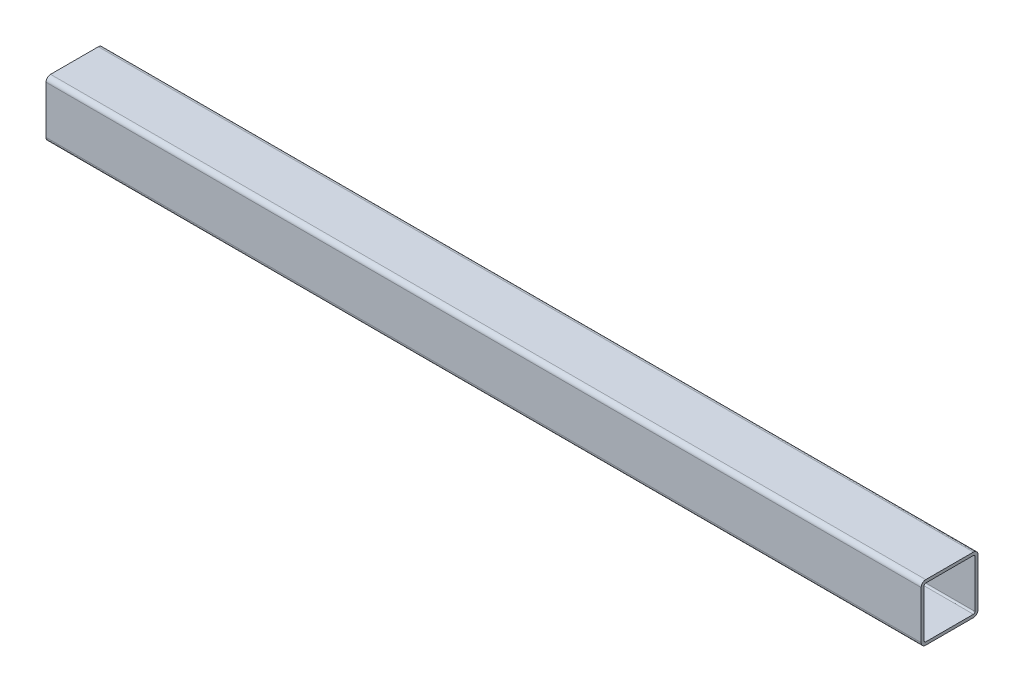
ISO-10303-21;
HEADER;
FILE_DESCRIPTION(('STEP AP214'),'2;1');
FILE_NAME('part.step','',(''),(''),'','','');
FILE_SCHEMA(('AUTOMOTIVE_DESIGN { 1 0 10303 214 1 1 1 1 }'));
ENDSEC;
DATA;
#1=APPLICATION_CONTEXT('core data for automotive mechanical design processes');
#2=APPLICATION_PROTOCOL_DEFINITION('international standard','automotive_design',2000,#1);
#3=PRODUCT_CONTEXT('',#1,'mechanical');
#4=PRODUCT('Part','Part','',(#3));
#5=PRODUCT_RELATED_PRODUCT_CATEGORY('part','',(#4));
#6=PRODUCT_DEFINITION_FORMATION('','',#4);
#7=PRODUCT_DEFINITION_CONTEXT('part definition',#1,'design');
#8=PRODUCT_DEFINITION('design','',#6,#7);
#9=PRODUCT_DEFINITION_SHAPE('','',#8);
#10=(LENGTH_UNIT() NAMED_UNIT(*) SI_UNIT(.MILLI.,.METRE.));
#11=(NAMED_UNIT(*) PLANE_ANGLE_UNIT() SI_UNIT($,.RADIAN.));
#12=(NAMED_UNIT(*) SI_UNIT($,.STERADIAN.) SOLID_ANGLE_UNIT());
#13=UNCERTAINTY_MEASURE_WITH_UNIT(LENGTH_MEASURE(1.E-05),#10,'distance_accuracy_value','');
#14=(GEOMETRIC_REPRESENTATION_CONTEXT(3) GLOBAL_UNCERTAINTY_ASSIGNED_CONTEXT((#13)) GLOBAL_UNIT_ASSIGNED_CONTEXT((#10,
#11,#12)) REPRESENTATION_CONTEXT('',''));
#15=CARTESIAN_POINT('',(0.,0.,0.));
#16=DIRECTION('',(0.,0.,1.));
#17=DIRECTION('',(1.,0.,0.));
#18=AXIS2_PLACEMENT_3D('',#15,#16,#17);
#19=CARTESIAN_POINT('',(488.95,2.54,29.21));
#20=DIRECTION('',(1.,0.,0.));
#21=DIRECTION('',(0.,0.,-1.));
#22=AXIS2_PLACEMENT_3D('',#19,#20,#21);
#23=PLANE('',#22);
#24=CARTESIAN_POINT('',(488.95,2.54,29.21));
#25=DIRECTION('',(1.,0.,0.));
#26=DIRECTION('',(0.,0.,-1.));
#27=AXIS2_PLACEMENT_3D('',#24,#25,#26);
#28=CIRCLE('',#27,2.54);
#29=CARTESIAN_POINT('',(488.95,2.54000000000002,31.75));
#30=VERTEX_POINT('',#29);
#31=CARTESIAN_POINT('',(488.95,0.,29.21));
#32=VERTEX_POINT('',#31);
#33=EDGE_CURVE('E217',#30,#32,#28,.T.);
#34=ORIENTED_EDGE('',*,*,#33,.T.);
#35=DIRECTION('',(0.,0.,-1.));
#36=VECTOR('',#35,1.);
#37=CARTESIAN_POINT('',(488.95,0.,29.21));
#38=LINE('',#37,#36);
#39=CARTESIAN_POINT('',(488.95,0.,2.54000000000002));
#40=VERTEX_POINT('',#39);
#41=EDGE_CURVE('E220',#32,#40,#38,.T.);
#42=ORIENTED_EDGE('',*,*,#41,.T.);
#43=CARTESIAN_POINT('',(488.95,2.54,2.54));
#44=DIRECTION('',(1.,0.,0.));
#45=DIRECTION('',(0.,0.,1.));
#46=AXIS2_PLACEMENT_3D('',#43,#44,#45);
#47=CIRCLE('',#46,2.54);
#48=CARTESIAN_POINT('',(488.95,2.54000000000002,0.));
#49=VERTEX_POINT('',#48);
#50=EDGE_CURVE('E223',#40,#49,#47,.T.);
#51=ORIENTED_EDGE('',*,*,#50,.T.);
#52=DIRECTION('',(0.,1.,0.));
#53=VECTOR('',#52,1.);
#54=CARTESIAN_POINT('',(488.95,2.54000000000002,0.));
#55=LINE('',#54,#53);
#56=CARTESIAN_POINT('',(488.95,29.21,0.));
#57=VERTEX_POINT('',#56);
#58=EDGE_CURVE('E225',#49,#57,#55,.T.);
#59=ORIENTED_EDGE('',*,*,#58,.T.);
#60=CARTESIAN_POINT('',(488.95,29.21,2.54));
#61=DIRECTION('',(1.,0.,0.));
#62=DIRECTION('',(0.,0.,-1.));
#63=AXIS2_PLACEMENT_3D('',#60,#61,#62);
#64=CIRCLE('',#63,2.54);
#65=CARTESIAN_POINT('',(488.95,31.75,2.54000000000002));
#66=VERTEX_POINT('',#65);
#67=EDGE_CURVE('E227',#57,#66,#64,.T.);
#68=ORIENTED_EDGE('',*,*,#67,.T.);
#69=DIRECTION('',(0.,0.,1.));
#70=VECTOR('',#69,1.);
#71=CARTESIAN_POINT('',(488.95,31.75,2.54000000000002));
#72=LINE('',#71,#70);
#73=CARTESIAN_POINT('',(488.95,31.75,29.21));
#74=VERTEX_POINT('',#73);
#75=EDGE_CURVE('E229',#66,#74,#72,.T.);
#76=ORIENTED_EDGE('',*,*,#75,.T.);
#77=CARTESIAN_POINT('',(488.95,29.21,29.21));
#78=DIRECTION('',(1.,0.,0.));
#79=DIRECTION('',(0.,0.,1.));
#80=AXIS2_PLACEMENT_3D('',#77,#78,#79);
#81=CIRCLE('',#80,2.54);
#82=CARTESIAN_POINT('',(488.95,29.21,31.75));
#83=VERTEX_POINT('',#82);
#84=EDGE_CURVE('E231',#74,#83,#81,.T.);
#85=ORIENTED_EDGE('',*,*,#84,.T.);
#86=DIRECTION('',(0.,-1.,0.));
#87=VECTOR('',#86,1.);
#88=CARTESIAN_POINT('',(488.95,29.21,31.75));
#89=LINE('',#88,#87);
#90=EDGE_CURVE('E233',#83,#30,#89,.T.);
#91=ORIENTED_EDGE('',*,*,#90,.T.);
#92=EDGE_LOOP('',(#34,#42,#51,#59,#68,#76,#85,#91));
#93=FACE_BOUND('',#92,.T.);
#94=DIRECTION('',(0.,1.,0.));
#95=VECTOR('',#94,1.);
#96=CARTESIAN_POINT('',(488.95,2.54000000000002,1.651));
#97=LINE('',#96,#95);
#98=CARTESIAN_POINT('',(488.95,2.54000000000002,1.651));
#99=VERTEX_POINT('',#98);
#100=CARTESIAN_POINT('',(488.95,29.21,1.651));
#101=VERTEX_POINT('',#100);
#102=EDGE_CURVE('E160',#99,#101,#97,.T.);
#103=ORIENTED_EDGE('',*,*,#102,.F.);
#104=CARTESIAN_POINT('',(488.95,2.54,2.54));
#105=DIRECTION('',(1.,0.,0.));
#106=DIRECTION('',(0.,0.,1.));
#107=AXIS2_PLACEMENT_3D('',#104,#105,#106);
#108=CIRCLE('',#107,0.889);
#109=CARTESIAN_POINT('',(488.95,1.651,2.54000000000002));
#110=VERTEX_POINT('',#109);
#111=EDGE_CURVE('E152',#110,#99,#108,.T.);
#112=ORIENTED_EDGE('',*,*,#111,.F.);
#113=DIRECTION('',(0.,0.,-1.));
#114=VECTOR('',#113,1.);
#115=CARTESIAN_POINT('',(488.95,1.651,29.21));
#116=LINE('',#115,#114);
#117=CARTESIAN_POINT('',(488.95,1.651,29.21));
#118=VERTEX_POINT('',#117);
#119=EDGE_CURVE('E185',#118,#110,#116,.T.);
#120=ORIENTED_EDGE('',*,*,#119,.F.);
#121=CARTESIAN_POINT('',(488.95,2.54,29.21));
#122=DIRECTION('',(1.,0.,0.));
#123=DIRECTION('',(0.,0.,-1.));
#124=AXIS2_PLACEMENT_3D('',#121,#122,#123);
#125=CIRCLE('',#124,0.889000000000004);
#126=CARTESIAN_POINT('',(488.95,2.54000000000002,30.099));
#127=VERTEX_POINT('',#126);
#128=EDGE_CURVE('E183',#127,#118,#125,.T.);
#129=ORIENTED_EDGE('',*,*,#128,.F.);
#130=DIRECTION('',(0.,-1.,0.));
#131=VECTOR('',#130,1.);
#132=CARTESIAN_POINT('',(488.95,29.21,30.099));
#133=LINE('',#132,#131);
#134=CARTESIAN_POINT('',(488.95,29.21,30.099));
#135=VERTEX_POINT('',#134);
#136=EDGE_CURVE('E181',#135,#127,#133,.T.);
#137=ORIENTED_EDGE('',*,*,#136,.F.);
#138=CARTESIAN_POINT('',(488.95,29.21,29.21));
#139=DIRECTION('',(1.,0.,0.));
#140=DIRECTION('',(0.,0.,1.));
#141=AXIS2_PLACEMENT_3D('',#138,#139,#140);
#142=CIRCLE('',#141,0.889000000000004);
#143=CARTESIAN_POINT('',(488.95,30.099,29.21));
#144=VERTEX_POINT('',#143);
#145=EDGE_CURVE('E179',#144,#135,#142,.T.);
#146=ORIENTED_EDGE('',*,*,#145,.F.);
#147=DIRECTION('',(0.,0.,1.));
#148=VECTOR('',#147,1.);
#149=CARTESIAN_POINT('',(488.95,30.099,2.54000000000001));
#150=LINE('',#149,#148);
#151=CARTESIAN_POINT('',(488.95,30.099,2.54000000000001));
#152=VERTEX_POINT('',#151);
#153=EDGE_CURVE('E175',#152,#144,#150,.T.);
#154=ORIENTED_EDGE('',*,*,#153,.F.);
#155=CARTESIAN_POINT('',(488.95,29.21,2.54));
#156=DIRECTION('',(1.,0.,0.));
#157=DIRECTION('',(0.,0.,-1.));
#158=AXIS2_PLACEMENT_3D('',#155,#156,#157);
#159=CIRCLE('',#158,0.889);
#160=EDGE_CURVE('E173',#101,#152,#159,.T.);
#161=ORIENTED_EDGE('',*,*,#160,.F.);
#162=EDGE_LOOP('',(#103,#112,#120,#129,#137,#146,#154,#161));
#163=FACE_BOUND('',#162,.T.);
#164=ADVANCED_FACE('F39',(#93,#163),#23,.T.);
#165=CARTESIAN_POINT('',(0.,2.54,29.21));
#166=DIRECTION('',(1.,0.,0.));
#167=DIRECTION('',(0.,0.,-1.));
#168=AXIS2_PLACEMENT_3D('',#165,#166,#167);
#169=PLANE('',#168);
#170=CARTESIAN_POINT('',(0.,2.54,29.21));
#171=DIRECTION('',(1.,0.,0.));
#172=DIRECTION('',(0.,0.,-1.));
#173=AXIS2_PLACEMENT_3D('',#170,#171,#172);
#174=CIRCLE('',#173,2.54);
#175=CARTESIAN_POINT('',(0.,2.54000000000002,31.75));
#176=VERTEX_POINT('',#175);
#177=CARTESIAN_POINT('',(0.,0.,29.21));
#178=VERTEX_POINT('',#177);
#179=EDGE_CURVE('E168',#176,#178,#174,.T.);
#180=ORIENTED_EDGE('',*,*,#179,.F.);
#181=DIRECTION('',(0.,-1.,0.));
#182=VECTOR('',#181,1.);
#183=CARTESIAN_POINT('',(0.,29.21,31.75));
#184=LINE('',#183,#182);
#185=CARTESIAN_POINT('',(0.,29.21,31.75));
#186=VERTEX_POINT('',#185);
#187=EDGE_CURVE('E221',#186,#176,#184,.T.);
#188=ORIENTED_EDGE('',*,*,#187,.F.);
#189=CARTESIAN_POINT('',(0.,29.21,29.21));
#190=DIRECTION('',(1.,0.,0.));
#191=DIRECTION('',(0.,0.,1.));
#192=AXIS2_PLACEMENT_3D('',#189,#190,#191);
#193=CIRCLE('',#192,2.54);
#194=CARTESIAN_POINT('',(0.,31.75,29.21));
#195=VERTEX_POINT('',#194);
#196=EDGE_CURVE('E248',#195,#186,#193,.T.);
#197=ORIENTED_EDGE('',*,*,#196,.F.);
#198=DIRECTION('',(0.,0.,1.));
#199=VECTOR('',#198,1.);
#200=CARTESIAN_POINT('',(0.,31.75,2.54000000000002));
#201=LINE('',#200,#199);
#202=CARTESIAN_POINT('',(0.,31.75,2.54000000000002));
#203=VERTEX_POINT('',#202);
#204=EDGE_CURVE('E246',#203,#195,#201,.T.);
#205=ORIENTED_EDGE('',*,*,#204,.F.);
#206=CARTESIAN_POINT('',(0.,29.21,2.54));
#207=DIRECTION('',(1.,0.,0.));
#208=DIRECTION('',(0.,0.,-1.));
#209=AXIS2_PLACEMENT_3D('',#206,#207,#208);
#210=CIRCLE('',#209,2.54);
#211=CARTESIAN_POINT('',(0.,29.21,0.));
#212=VERTEX_POINT('',#211);
#213=EDGE_CURVE('E244',#212,#203,#210,.T.);
#214=ORIENTED_EDGE('',*,*,#213,.F.);
#215=DIRECTION('',(0.,1.,0.));
#216=VECTOR('',#215,1.);
#217=CARTESIAN_POINT('',(0.,2.54000000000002,0.));
#218=LINE('',#217,#216);
#219=CARTESIAN_POINT('',(0.,2.54000000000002,0.));
#220=VERTEX_POINT('',#219);
#221=EDGE_CURVE('E242',#220,#212,#218,.T.);
#222=ORIENTED_EDGE('',*,*,#221,.F.);
#223=CARTESIAN_POINT('',(0.,2.54,2.54));
#224=DIRECTION('',(1.,0.,0.));
#225=DIRECTION('',(0.,0.,1.));
#226=AXIS2_PLACEMENT_3D('',#223,#224,#225);
#227=CIRCLE('',#226,2.54);
#228=CARTESIAN_POINT('',(0.,0.,2.54000000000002));
#229=VERTEX_POINT('',#228);
#230=EDGE_CURVE('E240',#229,#220,#227,.T.);
#231=ORIENTED_EDGE('',*,*,#230,.F.);
#232=DIRECTION('',(0.,0.,-1.));
#233=VECTOR('',#232,1.);
#234=CARTESIAN_POINT('',(0.,0.,29.21));
#235=LINE('',#234,#233);
#236=EDGE_CURVE('E238',#178,#229,#235,.T.);
#237=ORIENTED_EDGE('',*,*,#236,.F.);
#238=EDGE_LOOP('',(#180,#188,#197,#205,#214,#222,#231,#237));
#239=FACE_BOUND('',#238,.T.);
#240=CARTESIAN_POINT('',(0.,2.54,2.54));
#241=DIRECTION('',(1.,0.,0.));
#242=DIRECTION('',(0.,0.,1.));
#243=AXIS2_PLACEMENT_3D('',#240,#241,#242);
#244=CIRCLE('',#243,0.889);
#245=CARTESIAN_POINT('',(0.,1.651,2.54000000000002));
#246=VERTEX_POINT('',#245);
#247=CARTESIAN_POINT('',(0.,2.54000000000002,1.651));
#248=VERTEX_POINT('',#247);
#249=EDGE_CURVE('E62',#246,#248,#244,.T.);
#250=ORIENTED_EDGE('',*,*,#249,.T.);
#251=DIRECTION('',(0.,1.,0.));
#252=VECTOR('',#251,1.);
#253=CARTESIAN_POINT('',(0.,2.54000000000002,1.651));
#254=LINE('',#253,#252);
#255=CARTESIAN_POINT('',(0.,29.21,1.651));
#256=VERTEX_POINT('',#255);
#257=EDGE_CURVE('E167',#248,#256,#254,.T.);
#258=ORIENTED_EDGE('',*,*,#257,.T.);
#259=CARTESIAN_POINT('',(0.,29.21,2.54));
#260=DIRECTION('',(1.,0.,0.));
#261=DIRECTION('',(0.,0.,-1.));
#262=AXIS2_PLACEMENT_3D('',#259,#260,#261);
#263=CIRCLE('',#262,0.889);
#264=CARTESIAN_POINT('',(0.,30.099,2.54000000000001));
#265=VERTEX_POINT('',#264);
#266=EDGE_CURVE('E189',#256,#265,#263,.T.);
#267=ORIENTED_EDGE('',*,*,#266,.T.);
#268=DIRECTION('',(0.,0.,1.));
#269=VECTOR('',#268,1.);
#270=CARTESIAN_POINT('',(0.,30.099,2.54000000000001));
#271=LINE('',#270,#269);
#272=CARTESIAN_POINT('',(0.,30.099,29.21));
#273=VERTEX_POINT('',#272);
#274=EDGE_CURVE('E192',#265,#273,#271,.T.);
#275=ORIENTED_EDGE('',*,*,#274,.T.);
#276=CARTESIAN_POINT('',(0.,29.21,29.21));
#277=DIRECTION('',(1.,0.,0.));
#278=DIRECTION('',(0.,0.,1.));
#279=AXIS2_PLACEMENT_3D('',#276,#277,#278);
#280=CIRCLE('',#279,0.889000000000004);
#281=CARTESIAN_POINT('',(0.,29.21,30.099));
#282=VERTEX_POINT('',#281);
#283=EDGE_CURVE('E195',#273,#282,#280,.T.);
#284=ORIENTED_EDGE('',*,*,#283,.T.);
#285=DIRECTION('',(0.,-1.,0.));
#286=VECTOR('',#285,1.);
#287=CARTESIAN_POINT('',(0.,29.21,30.099));
#288=LINE('',#287,#286);
#289=CARTESIAN_POINT('',(0.,2.54000000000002,30.099));
#290=VERTEX_POINT('',#289);
#291=EDGE_CURVE('E198',#282,#290,#288,.T.);
#292=ORIENTED_EDGE('',*,*,#291,.T.);
#293=CARTESIAN_POINT('',(0.,2.54,29.21));
#294=DIRECTION('',(1.,0.,0.));
#295=DIRECTION('',(0.,0.,-1.));
#296=AXIS2_PLACEMENT_3D('',#293,#294,#295);
#297=CIRCLE('',#296,0.889000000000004);
#298=CARTESIAN_POINT('',(0.,1.651,29.21));
#299=VERTEX_POINT('',#298);
#300=EDGE_CURVE('E201',#290,#299,#297,.T.);
#301=ORIENTED_EDGE('',*,*,#300,.T.);
#302=DIRECTION('',(0.,0.,-1.));
#303=VECTOR('',#302,1.);
#304=CARTESIAN_POINT('',(0.,1.651,29.21));
#305=LINE('',#304,#303);
#306=EDGE_CURVE('E161',#299,#246,#305,.T.);
#307=ORIENTED_EDGE('',*,*,#306,.T.);
#308=EDGE_LOOP('',(#250,#258,#267,#275,#284,#292,#301,#307));
#309=FACE_BOUND('',#308,.T.);
#310=ADVANCED_FACE('F278',(#239,#309),#169,.F.);
#311=CARTESIAN_POINT('',(488.95,2.54,29.21));
#312=DIRECTION('',(-1.,0.,0.));
#313=DIRECTION('',(0.,0.,1.));
#314=AXIS2_PLACEMENT_3D('',#311,#312,#313);
#315=CYLINDRICAL_SURFACE('',#314,2.54);
#316=ORIENTED_EDGE('',*,*,#179,.T.);
#317=DIRECTION('',(-1.,0.,0.));
#318=VECTOR('',#317,1.);
#319=CARTESIAN_POINT('',(488.95,0.,29.21));
#320=LINE('',#319,#318);
#321=EDGE_CURVE('E11',#32,#178,#320,.T.);
#322=ORIENTED_EDGE('',*,*,#321,.F.);
#323=ORIENTED_EDGE('',*,*,#33,.F.);
#324=DIRECTION('',(-1.,0.,0.));
#325=VECTOR('',#324,1.);
#326=CARTESIAN_POINT('',(488.95,2.54000000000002,31.75));
#327=LINE('',#326,#325);
#328=EDGE_CURVE('E235',#30,#176,#327,.T.);
#329=ORIENTED_EDGE('',*,*,#328,.T.);
#330=EDGE_LOOP('',(#316,#322,#323,#329));
#331=FACE_BOUND('',#330,.T.);
#332=ADVANCED_FACE('F41',(#331),#315,.T.);
#333=CARTESIAN_POINT('',(488.95,0.,29.21));
#334=DIRECTION('',(0.,1.,0.));
#335=DIRECTION('',(0.,0.,1.));
#336=AXIS2_PLACEMENT_3D('',#333,#334,#335);
#337=PLANE('',#336);
#338=ORIENTED_EDGE('',*,*,#236,.T.);
#339=DIRECTION('',(-1.,0.,0.));
#340=VECTOR('',#339,1.);
#341=CARTESIAN_POINT('',(488.95,0.,2.54000000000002));
#342=LINE('',#341,#340);
#343=EDGE_CURVE('E47',#40,#229,#342,.T.);
#344=ORIENTED_EDGE('',*,*,#343,.F.);
#345=ORIENTED_EDGE('',*,*,#41,.F.);
#346=ORIENTED_EDGE('',*,*,#321,.T.);
#347=EDGE_LOOP('',(#338,#344,#345,#346));
#348=FACE_BOUND('',#347,.T.);
#349=ADVANCED_FACE('F295',(#348),#337,.F.);
#350=CARTESIAN_POINT('',(488.95,2.54,2.54));
#351=DIRECTION('',(-1.,0.,0.));
#352=DIRECTION('',(0.,0.,1.));
#353=AXIS2_PLACEMENT_3D('',#350,#351,#352);
#354=CYLINDRICAL_SURFACE('',#353,2.54);
#355=ORIENTED_EDGE('',*,*,#230,.T.);
#356=DIRECTION('',(-1.,0.,0.));
#357=VECTOR('',#356,1.);
#358=CARTESIAN_POINT('',(488.95,2.54000000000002,0.));
#359=LINE('',#358,#357);
#360=EDGE_CURVE('E265',#49,#220,#359,.T.);
#361=ORIENTED_EDGE('',*,*,#360,.F.);
#362=ORIENTED_EDGE('',*,*,#50,.F.);
#363=ORIENTED_EDGE('',*,*,#343,.T.);
#364=EDGE_LOOP('',(#355,#361,#362,#363));
#365=FACE_BOUND('',#364,.T.);
#366=ADVANCED_FACE('F272',(#365),#354,.T.);
#367=CARTESIAN_POINT('',(488.95,2.54000000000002,0.));
#368=DIRECTION('',(0.,0.,1.));
#369=DIRECTION('',(1.,0.,0.));
#370=AXIS2_PLACEMENT_3D('',#367,#368,#369);
#371=PLANE('',#370);
#372=ORIENTED_EDGE('',*,*,#221,.T.);
#373=DIRECTION('',(-1.,0.,0.));
#374=VECTOR('',#373,1.);
#375=CARTESIAN_POINT('',(488.95,29.21,0.));
#376=LINE('',#375,#374);
#377=EDGE_CURVE('E262',#57,#212,#376,.T.);
#378=ORIENTED_EDGE('',*,*,#377,.F.);
#379=ORIENTED_EDGE('',*,*,#58,.F.);
#380=ORIENTED_EDGE('',*,*,#360,.T.);
#381=EDGE_LOOP('',(#372,#378,#379,#380));
#382=FACE_BOUND('',#381,.T.);
#383=ADVANCED_FACE('F284',(#382),#371,.F.);
#384=CARTESIAN_POINT('',(488.95,29.21,2.54));
#385=DIRECTION('',(-1.,0.,0.));
#386=DIRECTION('',(0.,0.,1.));
#387=AXIS2_PLACEMENT_3D('',#384,#385,#386);
#388=CYLINDRICAL_SURFACE('',#387,2.54);
#389=ORIENTED_EDGE('',*,*,#213,.T.);
#390=DIRECTION('',(-1.,0.,0.));
#391=VECTOR('',#390,1.);
#392=CARTESIAN_POINT('',(488.95,31.75,2.54000000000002));
#393=LINE('',#392,#391);
#394=EDGE_CURVE('E259',#66,#203,#393,.T.);
#395=ORIENTED_EDGE('',*,*,#394,.F.);
#396=ORIENTED_EDGE('',*,*,#67,.F.);
#397=ORIENTED_EDGE('',*,*,#377,.T.);
#398=EDGE_LOOP('',(#389,#395,#396,#397));
#399=FACE_BOUND('',#398,.T.);
#400=ADVANCED_FACE('F288',(#399),#388,.T.);
#401=CARTESIAN_POINT('',(488.95,31.75,2.54000000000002));
#402=DIRECTION('',(0.,-1.,0.));
#403=DIRECTION('',(0.,0.,-1.));
#404=AXIS2_PLACEMENT_3D('',#401,#402,#403);
#405=PLANE('',#404);
#406=ORIENTED_EDGE('',*,*,#204,.T.);
#407=DIRECTION('',(-1.,0.,0.));
#408=VECTOR('',#407,1.);
#409=CARTESIAN_POINT('',(488.95,31.75,29.21));
#410=LINE('',#409,#408);
#411=EDGE_CURVE('E256',#74,#195,#410,.T.);
#412=ORIENTED_EDGE('',*,*,#411,.F.);
#413=ORIENTED_EDGE('',*,*,#75,.F.);
#414=ORIENTED_EDGE('',*,*,#394,.T.);
#415=EDGE_LOOP('',(#406,#412,#413,#414));
#416=FACE_BOUND('',#415,.T.);
#417=ADVANCED_FACE('F308',(#416),#405,.F.);
#418=CARTESIAN_POINT('',(488.95,29.21,29.21));
#419=DIRECTION('',(-1.,0.,0.));
#420=DIRECTION('',(0.,0.,1.));
#421=AXIS2_PLACEMENT_3D('',#418,#419,#420);
#422=CYLINDRICAL_SURFACE('',#421,2.54);
#423=ORIENTED_EDGE('',*,*,#196,.T.);
#424=DIRECTION('',(-1.,0.,0.));
#425=VECTOR('',#424,1.);
#426=CARTESIAN_POINT('',(488.95,29.21,31.75));
#427=LINE('',#426,#425);
#428=EDGE_CURVE('E253',#83,#186,#427,.T.);
#429=ORIENTED_EDGE('',*,*,#428,.F.);
#430=ORIENTED_EDGE('',*,*,#84,.F.);
#431=ORIENTED_EDGE('',*,*,#411,.T.);
#432=EDGE_LOOP('',(#423,#429,#430,#431));
#433=FACE_BOUND('',#432,.T.);
#434=ADVANCED_FACE('F306',(#433),#422,.T.);
#435=CARTESIAN_POINT('',(488.95,29.21,31.75));
#436=DIRECTION('',(0.,0.,-1.));
#437=DIRECTION('',(0.,1.,0.));
#438=AXIS2_PLACEMENT_3D('',#435,#436,#437);
#439=PLANE('',#438);
#440=ORIENTED_EDGE('',*,*,#187,.T.);
#441=ORIENTED_EDGE('',*,*,#328,.F.);
#442=ORIENTED_EDGE('',*,*,#90,.F.);
#443=ORIENTED_EDGE('',*,*,#428,.T.);
#444=EDGE_LOOP('',(#440,#441,#442,#443));
#445=FACE_BOUND('',#444,.T.);
#446=ADVANCED_FACE('F301',(#445),#439,.F.);
#447=CARTESIAN_POINT('',(488.95,2.54,2.54));
#448=DIRECTION('',(-1.,0.,0.));
#449=DIRECTION('',(0.,0.,1.));
#450=AXIS2_PLACEMENT_3D('',#447,#448,#449);
#451=CYLINDRICAL_SURFACE('',#450,0.889);
#452=ORIENTED_EDGE('',*,*,#249,.F.);
#453=DIRECTION('',(-1.,0.,0.));
#454=VECTOR('',#453,1.);
#455=CARTESIAN_POINT('',(488.95,1.651,2.54000000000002));
#456=LINE('',#455,#454);
#457=EDGE_CURVE('E156',#110,#246,#456,.T.);
#458=ORIENTED_EDGE('',*,*,#457,.F.);
#459=ORIENTED_EDGE('',*,*,#111,.T.);
#460=DIRECTION('',(-1.,0.,0.));
#461=VECTOR('',#460,1.);
#462=CARTESIAN_POINT('',(488.95,2.54000000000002,1.651));
#463=LINE('',#462,#461);
#464=EDGE_CURVE('E155',#99,#248,#463,.T.);
#465=ORIENTED_EDGE('',*,*,#464,.T.);
#466=EDGE_LOOP('',(#452,#458,#459,#465));
#467=FACE_BOUND('',#466,.T.);
#468=ADVANCED_FACE('F154',(#467),#451,.F.);
#469=CARTESIAN_POINT('',(488.95,2.54000000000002,1.651));
#470=DIRECTION('',(0.,0.,1.));
#471=DIRECTION('',(1.,0.,0.));
#472=AXIS2_PLACEMENT_3D('',#469,#470,#471);
#473=PLANE('',#472);
#474=ORIENTED_EDGE('',*,*,#257,.F.);
#475=ORIENTED_EDGE('',*,*,#464,.F.);
#476=ORIENTED_EDGE('',*,*,#102,.T.);
#477=DIRECTION('',(-1.,0.,0.));
#478=VECTOR('',#477,1.);
#479=CARTESIAN_POINT('',(488.95,29.21,1.651));
#480=LINE('',#479,#478);
#481=EDGE_CURVE('E169',#101,#256,#480,.T.);
#482=ORIENTED_EDGE('',*,*,#481,.T.);
#483=EDGE_LOOP('',(#474,#475,#476,#482));
#484=FACE_BOUND('',#483,.T.);
#485=ADVANCED_FACE('F164',(#484),#473,.T.);
#486=CARTESIAN_POINT('',(488.95,29.21,2.54));
#487=DIRECTION('',(-1.,0.,0.));
#488=DIRECTION('',(0.,0.,1.));
#489=AXIS2_PLACEMENT_3D('',#486,#487,#488);
#490=CYLINDRICAL_SURFACE('',#489,0.889);
#491=ORIENTED_EDGE('',*,*,#266,.F.);
#492=ORIENTED_EDGE('',*,*,#481,.F.);
#493=ORIENTED_EDGE('',*,*,#160,.T.);
#494=DIRECTION('',(-1.,0.,0.));
#495=VECTOR('',#494,1.);
#496=CARTESIAN_POINT('',(488.95,30.099,2.54000000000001));
#497=LINE('',#496,#495);
#498=EDGE_CURVE('E214',#152,#265,#497,.T.);
#499=ORIENTED_EDGE('',*,*,#498,.T.);
#500=EDGE_LOOP('',(#491,#492,#493,#499));
#501=FACE_BOUND('',#500,.T.);
#502=ADVANCED_FACE('F333',(#501),#490,.F.);
#503=CARTESIAN_POINT('',(488.95,30.099,2.54000000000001));
#504=DIRECTION('',(0.,-1.,0.));
#505=DIRECTION('',(0.,0.,-1.));
#506=AXIS2_PLACEMENT_3D('',#503,#504,#505);
#507=PLANE('',#506);
#508=ORIENTED_EDGE('',*,*,#274,.F.);
#509=ORIENTED_EDGE('',*,*,#498,.F.);
#510=ORIENTED_EDGE('',*,*,#153,.T.);
#511=DIRECTION('',(-1.,0.,0.));
#512=VECTOR('',#511,1.);
#513=CARTESIAN_POINT('',(488.95,30.099,29.21));
#514=LINE('',#513,#512);
#515=EDGE_CURVE('E212',#144,#273,#514,.T.);
#516=ORIENTED_EDGE('',*,*,#515,.T.);
#517=EDGE_LOOP('',(#508,#509,#510,#516));
#518=FACE_BOUND('',#517,.T.);
#519=ADVANCED_FACE('F337',(#518),#507,.T.);
#520=CARTESIAN_POINT('',(488.95,29.21,29.21));
#521=DIRECTION('',(-1.,0.,0.));
#522=DIRECTION('',(0.,0.,1.));
#523=AXIS2_PLACEMENT_3D('',#520,#521,#522);
#524=CYLINDRICAL_SURFACE('',#523,0.889000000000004);
#525=ORIENTED_EDGE('',*,*,#283,.F.);
#526=ORIENTED_EDGE('',*,*,#515,.F.);
#527=ORIENTED_EDGE('',*,*,#145,.T.);
#528=DIRECTION('',(-1.,0.,0.));
#529=VECTOR('',#528,1.);
#530=CARTESIAN_POINT('',(488.95,29.21,30.099));
#531=LINE('',#530,#529);
#532=EDGE_CURVE('E210',#135,#282,#531,.T.);
#533=ORIENTED_EDGE('',*,*,#532,.T.);
#534=EDGE_LOOP('',(#525,#526,#527,#533));
#535=FACE_BOUND('',#534,.T.);
#536=ADVANCED_FACE('F343',(#535),#524,.F.);
#537=CARTESIAN_POINT('',(488.95,29.21,30.099));
#538=DIRECTION('',(0.,0.,-1.));
#539=DIRECTION('',(-1.,0.,0.));
#540=AXIS2_PLACEMENT_3D('',#537,#538,#539);
#541=PLANE('',#540);
#542=ORIENTED_EDGE('',*,*,#291,.F.);
#543=ORIENTED_EDGE('',*,*,#532,.F.);
#544=ORIENTED_EDGE('',*,*,#136,.T.);
#545=DIRECTION('',(-1.,0.,0.));
#546=VECTOR('',#545,1.);
#547=CARTESIAN_POINT('',(488.95,2.54000000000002,30.099));
#548=LINE('',#547,#546);
#549=EDGE_CURVE('E208',#127,#290,#548,.T.);
#550=ORIENTED_EDGE('',*,*,#549,.T.);
#551=EDGE_LOOP('',(#542,#543,#544,#550));
#552=FACE_BOUND('',#551,.T.);
#553=ADVANCED_FACE('F347',(#552),#541,.T.);
#554=CARTESIAN_POINT('',(488.95,2.54,29.21));
#555=DIRECTION('',(-1.,0.,0.));
#556=DIRECTION('',(0.,0.,1.));
#557=AXIS2_PLACEMENT_3D('',#554,#555,#556);
#558=CYLINDRICAL_SURFACE('',#557,0.889000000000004);
#559=ORIENTED_EDGE('',*,*,#300,.F.);
#560=ORIENTED_EDGE('',*,*,#549,.F.);
#561=ORIENTED_EDGE('',*,*,#128,.T.);
#562=DIRECTION('',(-1.,0.,0.));
#563=VECTOR('',#562,1.);
#564=CARTESIAN_POINT('',(488.95,1.651,29.21));
#565=LINE('',#564,#563);
#566=EDGE_CURVE('E54',#118,#299,#565,.T.);
#567=ORIENTED_EDGE('',*,*,#566,.T.);
#568=EDGE_LOOP('',(#559,#560,#561,#567));
#569=FACE_BOUND('',#568,.T.);
#570=ADVANCED_FACE('F351',(#569),#558,.F.);
#571=CARTESIAN_POINT('',(488.95,1.651,29.21));
#572=DIRECTION('',(0.,1.,0.));
#573=DIRECTION('',(0.,0.,1.));
#574=AXIS2_PLACEMENT_3D('',#571,#572,#573);
#575=PLANE('',#574);
#576=ORIENTED_EDGE('',*,*,#306,.F.);
#577=ORIENTED_EDGE('',*,*,#566,.F.);
#578=ORIENTED_EDGE('',*,*,#119,.T.);
#579=ORIENTED_EDGE('',*,*,#457,.T.);
#580=EDGE_LOOP('',(#576,#577,#578,#579));
#581=FACE_BOUND('',#580,.T.);
#582=ADVANCED_FACE('F355',(#581),#575,.T.);
#583=CLOSED_SHELL('',(#164,#310,#332,#349,#366,#383,#400,#417,#434,#446,#468,#485,#502,#519,
#536,#553,#570,#582));
#584=MANIFOLD_SOLID_BREP('B2',#583);
#585=ADVANCED_BREP_SHAPE_REPRESENTATION('',(#18,#584),#14);
#586=SHAPE_DEFINITION_REPRESENTATION(#9,#585);
ENDSEC;
END-ISO-10303-21;
